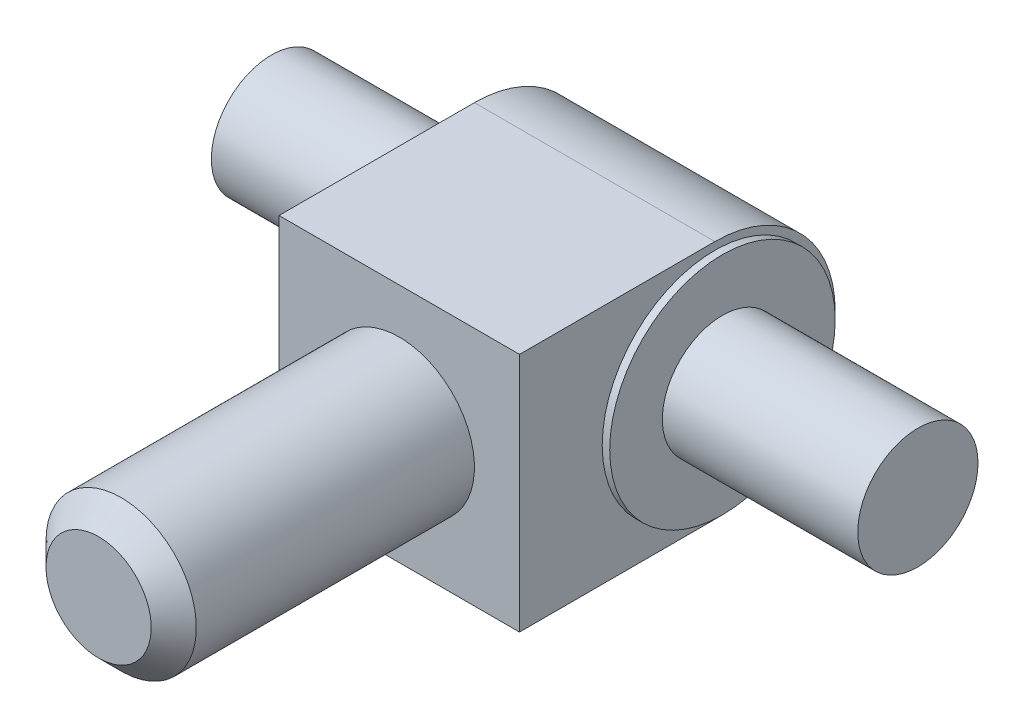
ISO-10303-21;
HEADER;
FILE_DESCRIPTION(('STEP AP214'),'2;1');
FILE_NAME('part.step','',(''),(''),'','','');
FILE_SCHEMA(('AUTOMOTIVE_DESIGN { 1 0 10303 214 1 1 1 1 }'));
ENDSEC;
DATA;
#1=APPLICATION_CONTEXT('core data for automotive mechanical design processes');
#2=APPLICATION_PROTOCOL_DEFINITION('international standard','automotive_design',2000,#1);
#3=PRODUCT_CONTEXT('',#1,'mechanical');
#4=PRODUCT('Part','Part','',(#3));
#5=PRODUCT_RELATED_PRODUCT_CATEGORY('part','',(#4));
#6=PRODUCT_DEFINITION_FORMATION('','',#4);
#7=PRODUCT_DEFINITION_CONTEXT('part definition',#1,'design');
#8=PRODUCT_DEFINITION('design','',#6,#7);
#9=PRODUCT_DEFINITION_SHAPE('','',#8);
#10=(LENGTH_UNIT() NAMED_UNIT(*) SI_UNIT(.MILLI.,.METRE.));
#11=(NAMED_UNIT(*) PLANE_ANGLE_UNIT() SI_UNIT($,.RADIAN.));
#12=(NAMED_UNIT(*) SI_UNIT($,.STERADIAN.) SOLID_ANGLE_UNIT());
#13=UNCERTAINTY_MEASURE_WITH_UNIT(LENGTH_MEASURE(1.E-05),#10,'distance_accuracy_value','');
#14=(GEOMETRIC_REPRESENTATION_CONTEXT(3) GLOBAL_UNCERTAINTY_ASSIGNED_CONTEXT((#13)) GLOBAL_UNIT_ASSIGNED_CONTEXT((#10,
#11,#12)) REPRESENTATION_CONTEXT('',''));
#15=CARTESIAN_POINT('',(0.,0.,0.));
#16=DIRECTION('',(0.,0.,1.));
#17=DIRECTION('',(1.,0.,0.));
#18=AXIS2_PLACEMENT_3D('',#15,#16,#17);
#19=CARTESIAN_POINT('',(-8.,-8.,-8.));
#20=DIRECTION('',(1.,0.,0.));
#21=DIRECTION('',(0.,1.,0.));
#22=AXIS2_PLACEMENT_3D('',#19,#20,#21);
#23=PLANE('',#22);
#24=CARTESIAN_POINT('',(-8.,0.,0.));
#25=DIRECTION('',(1.,0.,0.));
#26=DIRECTION('',(0.,1.,0.));
#27=AXIS2_PLACEMENT_3D('',#24,#25,#26);
#28=CIRCLE('',#27,8.);
#29=CARTESIAN_POINT('',(-8.,8.,0.));
#30=VERTEX_POINT('',#29);
#31=CARTESIAN_POINT('',(-8.,0.,-8.));
#32=VERTEX_POINT('',#31);
#33=EDGE_CURVE('E29',#30,#32,#28,.F.);
#34=ORIENTED_EDGE('',*,*,#33,.T.);
#35=CARTESIAN_POINT('',(-8.,0.,0.));
#36=DIRECTION('',(1.,0.,0.));
#37=DIRECTION('',(0.,1.,0.));
#38=AXIS2_PLACEMENT_3D('',#35,#36,#37);
#39=CIRCLE('',#38,8.);
#40=CARTESIAN_POINT('',(-8.,-8.,0.));
#41=VERTEX_POINT('',#40);
#42=EDGE_CURVE('E94',#32,#41,#39,.F.);
#43=ORIENTED_EDGE('',*,*,#42,.T.);
#44=DIRECTION('',(0.,0.,1.));
#45=VECTOR('',#44,1.);
#46=CARTESIAN_POINT('',(-8.,-8.,-8.));
#47=LINE('',#46,#45);
#48=CARTESIAN_POINT('',(-8.,-8.,13.));
#49=VERTEX_POINT('',#48);
#50=EDGE_CURVE('E66',#41,#49,#47,.T.);
#51=ORIENTED_EDGE('',*,*,#50,.T.);
#52=DIRECTION('',(0.,1.,0.));
#53=VECTOR('',#52,1.);
#54=CARTESIAN_POINT('',(-8.,-8.,13.));
#55=LINE('',#54,#53);
#56=CARTESIAN_POINT('',(-8.,8.,13.));
#57=VERTEX_POINT('',#56);
#58=EDGE_CURVE('E61',#49,#57,#55,.T.);
#59=ORIENTED_EDGE('',*,*,#58,.T.);
#60=DIRECTION('',(0.,0.,1.));
#61=VECTOR('',#60,1.);
#62=CARTESIAN_POINT('',(-8.,8.,-8.));
#63=LINE('',#62,#61);
#64=EDGE_CURVE('E64',#30,#57,#63,.T.);
#65=ORIENTED_EDGE('',*,*,#64,.F.);
#66=EDGE_LOOP('',(#34,#43,#51,#59,#65));
#67=FACE_BOUND('',#66,.T.);
#68=CARTESIAN_POINT('',(-8.,0.,0.));
#69=DIRECTION('',(1.,0.,0.));
#70=DIRECTION('',(0.,1.,0.));
#71=AXIS2_PLACEMENT_3D('',#68,#69,#70);
#72=CIRCLE('',#71,7.5);
#73=CARTESIAN_POINT('',(-8.,7.5,0.));
#74=VERTEX_POINT('',#73);
#75=EDGE_CURVE('E9',#74,#74,#72,.F.);
#76=ORIENTED_EDGE('',*,*,#75,.F.);
#77=EDGE_LOOP('',(#76));
#78=FACE_BOUND('',#77,.T.);
#79=ADVANCED_FACE('F14',(#67,#78),#23,.F.);
#80=CARTESIAN_POINT('',(8.,8.,-8.));
#81=DIRECTION('',(-1.,0.,0.));
#82=DIRECTION('',(0.,0.,-1.));
#83=AXIS2_PLACEMENT_3D('',#80,#81,#82);
#84=PLANE('',#83);
#85=DIRECTION('',(0.,0.,1.));
#86=VECTOR('',#85,1.);
#87=CARTESIAN_POINT('',(8.,-8.,-8.));
#88=LINE('',#87,#86);
#89=CARTESIAN_POINT('',(8.,-8.,0.));
#90=VERTEX_POINT('',#89);
#91=CARTESIAN_POINT('',(8.,-8.,13.));
#92=VERTEX_POINT('',#91);
#93=EDGE_CURVE('E83',#90,#92,#88,.T.);
#94=ORIENTED_EDGE('',*,*,#93,.F.);
#95=CARTESIAN_POINT('',(8.,0.,0.));
#96=DIRECTION('',(-1.,0.,0.));
#97=DIRECTION('',(0.,0.,-1.));
#98=AXIS2_PLACEMENT_3D('',#95,#96,#97);
#99=CIRCLE('',#98,8.);
#100=CARTESIAN_POINT('',(8.,0.,-8.));
#101=VERTEX_POINT('',#100);
#102=EDGE_CURVE('E91',#90,#101,#99,.F.);
#103=ORIENTED_EDGE('',*,*,#102,.T.);
#104=CARTESIAN_POINT('',(8.,0.,0.));
#105=DIRECTION('',(-1.,0.,0.));
#106=DIRECTION('',(0.,0.,-1.));
#107=AXIS2_PLACEMENT_3D('',#104,#105,#106);
#108=CIRCLE('',#107,8.);
#109=CARTESIAN_POINT('',(8.,8.,0.));
#110=VERTEX_POINT('',#109);
#111=EDGE_CURVE('E89',#101,#110,#108,.F.);
#112=ORIENTED_EDGE('',*,*,#111,.T.);
#113=DIRECTION('',(0.,0.,1.));
#114=VECTOR('',#113,1.);
#115=CARTESIAN_POINT('',(8.,8.,-8.));
#116=LINE('',#115,#114);
#117=CARTESIAN_POINT('',(8.,8.,13.));
#118=VERTEX_POINT('',#117);
#119=EDGE_CURVE('E81',#110,#118,#116,.T.);
#120=ORIENTED_EDGE('',*,*,#119,.T.);
#121=DIRECTION('',(0.,-1.,0.));
#122=VECTOR('',#121,1.);
#123=CARTESIAN_POINT('',(8.,8.,13.));
#124=LINE('',#123,#122);
#125=EDGE_CURVE('E77',#118,#92,#124,.T.);
#126=ORIENTED_EDGE('',*,*,#125,.T.);
#127=EDGE_LOOP('',(#94,#103,#112,#120,#126));
#128=FACE_BOUND('',#127,.T.);
#129=CARTESIAN_POINT('',(8.,0.,0.));
#130=DIRECTION('',(-1.,0.,0.));
#131=DIRECTION('',(0.,0.,1.));
#132=AXIS2_PLACEMENT_3D('',#129,#130,#131);
#133=CIRCLE('',#132,7.5);
#134=CARTESIAN_POINT('',(8.,0.,7.5));
#135=VERTEX_POINT('',#134);
#136=EDGE_CURVE('E22',#135,#135,#133,.F.);
#137=ORIENTED_EDGE('',*,*,#136,.F.);
#138=EDGE_LOOP('',(#137));
#139=FACE_BOUND('',#138,.T.);
#140=ADVANCED_FACE('F107',(#128,#139),#84,.F.);
#141=CARTESIAN_POINT('',(-8.,8.,13.));
#142=DIRECTION('',(0.,0.,1.));
#143=DIRECTION('',(-1.,0.,0.));
#144=AXIS2_PLACEMENT_3D('',#141,#142,#143);
#145=PLANE('',#144);
#146=DIRECTION('',(1.,0.,0.));
#147=VECTOR('',#146,1.);
#148=CARTESIAN_POINT('',(-8.,-8.,13.));
#149=LINE('',#148,#147);
#150=EDGE_CURVE('E71',#49,#92,#149,.T.);
#151=ORIENTED_EDGE('',*,*,#150,.T.);
#152=ORIENTED_EDGE('',*,*,#125,.F.);
#153=DIRECTION('',(-1.,0.,0.));
#154=VECTOR('',#153,1.);
#155=CARTESIAN_POINT('',(8.,8.,13.));
#156=LINE('',#155,#154);
#157=EDGE_CURVE('E74',#118,#57,#156,.T.);
#158=ORIENTED_EDGE('',*,*,#157,.T.);
#159=ORIENTED_EDGE('',*,*,#58,.F.);
#160=EDGE_LOOP('',(#151,#152,#158,#159));
#161=FACE_BOUND('',#160,.T.);
#162=CARTESIAN_POINT('',(0.,0.,13.));
#163=DIRECTION('',(0.,0.,1.));
#164=DIRECTION('',(-1.,0.,0.));
#165=AXIS2_PLACEMENT_3D('',#162,#163,#164);
#166=CIRCLE('',#165,5.);
#167=CARTESIAN_POINT('',(-5.,0.,13.));
#168=VERTEX_POINT('',#167);
#169=EDGE_CURVE('E142',#168,#168,#166,.T.);
#170=ORIENTED_EDGE('',*,*,#169,.F.);
#171=EDGE_LOOP('',(#170));
#172=FACE_BOUND('',#171,.T.);
#173=ADVANCED_FACE('F75',(#161,#172),#145,.T.);
#174=CARTESIAN_POINT('',(8.,8.,-8.));
#175=DIRECTION('',(0.,1.,0.));
#176=DIRECTION('',(-1.,0.,0.));
#177=AXIS2_PLACEMENT_3D('',#174,#175,#176);
#178=PLANE('',#177);
#179=ORIENTED_EDGE('',*,*,#119,.F.);
#180=DIRECTION('',(-1.,0.,0.));
#181=VECTOR('',#180,1.);
#182=CARTESIAN_POINT('',(8.,8.,0.));
#183=LINE('',#182,#181);
#184=EDGE_CURVE('E37',#110,#30,#183,.T.);
#185=ORIENTED_EDGE('',*,*,#184,.T.);
#186=ORIENTED_EDGE('',*,*,#64,.T.);
#187=ORIENTED_EDGE('',*,*,#157,.F.);
#188=EDGE_LOOP('',(#179,#185,#186,#187));
#189=FACE_BOUND('',#188,.T.);
#190=ADVANCED_FACE('F80',(#189),#178,.T.);
#191=CARTESIAN_POINT('',(-8.,-8.,-8.));
#192=DIRECTION('',(0.,-1.,0.));
#193=DIRECTION('',(1.,0.,0.));
#194=AXIS2_PLACEMENT_3D('',#191,#192,#193);
#195=PLANE('',#194);
#196=ORIENTED_EDGE('',*,*,#50,.F.);
#197=DIRECTION('',(1.,0.,0.));
#198=VECTOR('',#197,1.);
#199=CARTESIAN_POINT('',(-8.,-8.,0.));
#200=LINE('',#199,#198);
#201=EDGE_CURVE('E70',#41,#90,#200,.T.);
#202=ORIENTED_EDGE('',*,*,#201,.T.);
#203=ORIENTED_EDGE('',*,*,#93,.T.);
#204=ORIENTED_EDGE('',*,*,#150,.F.);
#205=EDGE_LOOP('',(#196,#202,#203,#204));
#206=FACE_BOUND('',#205,.T.);
#207=ADVANCED_FACE('F122',(#206),#195,.T.);
#208=CARTESIAN_POINT('',(8.,0.,0.));
#209=DIRECTION('',(1.,0.,0.));
#210=DIRECTION('',(0.,1.,0.));
#211=AXIS2_PLACEMENT_3D('',#208,#209,#210);
#212=CYLINDRICAL_SURFACE('',#211,8.);
#213=DIRECTION('',(-1.,0.,0.));
#214=VECTOR('',#213,1.);
#215=CARTESIAN_POINT('',(8.,0.,-8.));
#216=LINE('',#215,#214);
#217=EDGE_CURVE('E156',#32,#101,#216,.F.);
#218=ORIENTED_EDGE('',*,*,#217,.F.);
#219=ORIENTED_EDGE('',*,*,#33,.F.);
#220=ORIENTED_EDGE('',*,*,#184,.F.);
#221=ORIENTED_EDGE('',*,*,#111,.F.);
#222=EDGE_LOOP('',(#218,#219,#220,#221));
#223=FACE_BOUND('',#222,.T.);
#224=ADVANCED_FACE('F166',(#223),#212,.T.);
#225=CARTESIAN_POINT('',(-8.,0.,0.));
#226=DIRECTION('',(-1.,0.,0.));
#227=DIRECTION('',(0.,-1.,0.));
#228=AXIS2_PLACEMENT_3D('',#225,#226,#227);
#229=CYLINDRICAL_SURFACE('',#228,8.);
#230=ORIENTED_EDGE('',*,*,#42,.F.);
#231=ORIENTED_EDGE('',*,*,#217,.T.);
#232=ORIENTED_EDGE('',*,*,#102,.F.);
#233=ORIENTED_EDGE('',*,*,#201,.F.);
#234=EDGE_LOOP('',(#230,#231,#232,#233));
#235=FACE_BOUND('',#234,.T.);
#236=ADVANCED_FACE('F128',(#235),#229,.T.);
#237=CARTESIAN_POINT('',(0.,0.,33.));
#238=DIRECTION('',(0.,0.,1.));
#239=DIRECTION('',(-1.,0.,0.));
#240=AXIS2_PLACEMENT_3D('',#237,#238,#239);
#241=PLANE('',#240);
#242=CARTESIAN_POINT('',(0.,0.,33.));
#243=DIRECTION('',(0.,0.,1.));
#244=DIRECTION('',(-1.,0.,0.));
#245=AXIS2_PLACEMENT_3D('',#242,#243,#244);
#246=CIRCLE('',#245,3.5);
#247=CARTESIAN_POINT('',(-3.5,0.,33.));
#248=VERTEX_POINT('',#247);
#249=EDGE_CURVE('E97',#248,#248,#246,.T.);
#250=ORIENTED_EDGE('',*,*,#249,.T.);
#251=EDGE_LOOP('',(#250));
#252=FACE_BOUND('',#251,.T.);
#253=ADVANCED_FACE('F125',(#252),#241,.T.);
#254=CARTESIAN_POINT('',(0.,0.,33.));
#255=DIRECTION('',(0.,0.,-1.));
#256=DIRECTION('',(1.,0.,0.));
#257=AXIS2_PLACEMENT_3D('',#254,#255,#256);
#258=CYLINDRICAL_SURFACE('',#257,5.);
#259=CARTESIAN_POINT('',(0.,0.,31.5));
#260=DIRECTION('',(0.,0.,1.));
#261=DIRECTION('',(-1.,0.,0.));
#262=AXIS2_PLACEMENT_3D('',#259,#260,#261);
#263=CIRCLE('',#262,5.);
#264=CARTESIAN_POINT('',(-5.,0.,31.5));
#265=VERTEX_POINT('',#264);
#266=EDGE_CURVE('E100',#265,#265,#263,.F.);
#267=ORIENTED_EDGE('',*,*,#266,.T.);
#268=EDGE_LOOP('',(#267));
#269=FACE_BOUND('',#268,.T.);
#270=ORIENTED_EDGE('',*,*,#169,.T.);
#271=EDGE_LOOP('',(#270));
#272=FACE_BOUND('',#271,.T.);
#273=ADVANCED_FACE('F127',(#269,#272),#258,.T.);
#274=CARTESIAN_POINT('',(0.,0.,33.));
#275=DIRECTION('',(0.,0.,-1.));
#276=DIRECTION('',(1.,0.,0.));
#277=AXIS2_PLACEMENT_3D('',#274,#275,#276);
#278=CONICAL_SURFACE('',#277,3.5,0.785398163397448);
#279=ORIENTED_EDGE('',*,*,#266,.F.);
#280=EDGE_LOOP('',(#279));
#281=FACE_BOUND('',#280,.T.);
#282=ORIENTED_EDGE('',*,*,#249,.F.);
#283=EDGE_LOOP('',(#282));
#284=FACE_BOUND('',#283,.T.);
#285=ADVANCED_FACE('F16',(#281,#284),#278,.T.);
#286=CARTESIAN_POINT('',(8.5,0.,0.));
#287=DIRECTION('',(1.,0.,0.));
#288=DIRECTION('',(0.,0.,-1.));
#289=AXIS2_PLACEMENT_3D('',#286,#287,#288);
#290=PLANE('',#289);
#291=CARTESIAN_POINT('',(8.5,0.,0.));
#292=DIRECTION('',(1.,0.,0.));
#293=DIRECTION('',(0.,0.,-1.));
#294=AXIS2_PLACEMENT_3D('',#291,#292,#293);
#295=CIRCLE('',#294,7.5);
#296=CARTESIAN_POINT('',(8.5,0.,-7.5));
#297=VERTEX_POINT('',#296);
#298=EDGE_CURVE('E144',#297,#297,#295,.T.);
#299=ORIENTED_EDGE('',*,*,#298,.T.);
#300=EDGE_LOOP('',(#299));
#301=FACE_BOUND('',#300,.T.);
#302=CARTESIAN_POINT('',(8.5,0.,0.));
#303=DIRECTION('',(1.,0.,0.));
#304=DIRECTION('',(0.,0.,-1.));
#305=AXIS2_PLACEMENT_3D('',#302,#303,#304);
#306=CIRCLE('',#305,4.);
#307=CARTESIAN_POINT('',(8.5,0.,-4.));
#308=VERTEX_POINT('',#307);
#309=EDGE_CURVE('E150',#308,#308,#306,.T.);
#310=ORIENTED_EDGE('',*,*,#309,.F.);
#311=EDGE_LOOP('',(#310));
#312=FACE_BOUND('',#311,.T.);
#313=ADVANCED_FACE('F136',(#301,#312),#290,.T.);
#314=CARTESIAN_POINT('',(8.5,0.,0.));
#315=DIRECTION('',(-1.,0.,0.));
#316=DIRECTION('',(0.,0.,1.));
#317=AXIS2_PLACEMENT_3D('',#314,#315,#316);
#318=CYLINDRICAL_SURFACE('',#317,7.5);
#319=ORIENTED_EDGE('',*,*,#298,.F.);
#320=EDGE_LOOP('',(#319));
#321=FACE_BOUND('',#320,.T.);
#322=ORIENTED_EDGE('',*,*,#136,.T.);
#323=EDGE_LOOP('',(#322));
#324=FACE_BOUND('',#323,.T.);
#325=ADVANCED_FACE('F105',(#321,#324),#318,.T.);
#326=CARTESIAN_POINT('',(21.5,0.,0.));
#327=DIRECTION('',(-1.,0.,0.));
#328=DIRECTION('',(0.,-1.,0.));
#329=AXIS2_PLACEMENT_3D('',#326,#327,#328);
#330=PLANE('',#329);
#331=CARTESIAN_POINT('',(21.5,0.,0.));
#332=DIRECTION('',(-1.,0.,0.));
#333=DIRECTION('',(0.,-1.,0.));
#334=AXIS2_PLACEMENT_3D('',#331,#332,#333);
#335=CIRCLE('',#334,4.);
#336=CARTESIAN_POINT('',(21.5,-4.,0.));
#337=VERTEX_POINT('',#336);
#338=EDGE_CURVE('E143',#337,#337,#335,.T.);
#339=ORIENTED_EDGE('',*,*,#338,.F.);
#340=EDGE_LOOP('',(#339));
#341=FACE_BOUND('',#340,.T.);
#342=ADVANCED_FACE('F187',(#341),#330,.F.);
#343=CARTESIAN_POINT('',(-21.5,0.,0.));
#344=DIRECTION('',(1.,0.,0.));
#345=DIRECTION('',(0.,1.,0.));
#346=AXIS2_PLACEMENT_3D('',#343,#344,#345);
#347=CYLINDRICAL_SURFACE('',#346,4.);
#348=ORIENTED_EDGE('',*,*,#309,.T.);
#349=EDGE_LOOP('',(#348));
#350=FACE_BOUND('',#349,.T.);
#351=ORIENTED_EDGE('',*,*,#338,.T.);
#352=EDGE_LOOP('',(#351));
#353=FACE_BOUND('',#352,.T.);
#354=ADVANCED_FACE('F182',(#350,#353),#347,.T.);
#355=CARTESIAN_POINT('',(-8.5,0.,0.));
#356=DIRECTION('',(-1.,0.,0.));
#357=DIRECTION('',(0.,-1.,0.));
#358=AXIS2_PLACEMENT_3D('',#355,#356,#357);
#359=PLANE('',#358);
#360=CARTESIAN_POINT('',(-8.5,0.,0.));
#361=DIRECTION('',(-1.,0.,0.));
#362=DIRECTION('',(0.,-1.,0.));
#363=AXIS2_PLACEMENT_3D('',#360,#361,#362);
#364=CIRCLE('',#363,7.5);
#365=CARTESIAN_POINT('',(-8.5,-7.5,0.));
#366=VERTEX_POINT('',#365);
#367=EDGE_CURVE('E211',#366,#366,#364,.T.);
#368=ORIENTED_EDGE('',*,*,#367,.T.);
#369=EDGE_LOOP('',(#368));
#370=FACE_BOUND('',#369,.T.);
#371=CARTESIAN_POINT('',(-8.5,0.,0.));
#372=DIRECTION('',(-1.,0.,0.));
#373=DIRECTION('',(0.,-1.,0.));
#374=AXIS2_PLACEMENT_3D('',#371,#372,#373);
#375=CIRCLE('',#374,4.);
#376=CARTESIAN_POINT('',(-8.5,-4.,0.));
#377=VERTEX_POINT('',#376);
#378=EDGE_CURVE('E214',#377,#377,#375,.T.);
#379=ORIENTED_EDGE('',*,*,#378,.F.);
#380=EDGE_LOOP('',(#379));
#381=FACE_BOUND('',#380,.T.);
#382=ADVANCED_FACE('F199',(#370,#381),#359,.T.);
#383=CARTESIAN_POINT('',(-8.5,0.,0.));
#384=DIRECTION('',(1.,0.,0.));
#385=DIRECTION('',(0.,1.,0.));
#386=AXIS2_PLACEMENT_3D('',#383,#384,#385);
#387=CYLINDRICAL_SURFACE('',#386,7.5);
#388=ORIENTED_EDGE('',*,*,#367,.F.);
#389=EDGE_LOOP('',(#388));
#390=FACE_BOUND('',#389,.T.);
#391=ORIENTED_EDGE('',*,*,#75,.T.);
#392=EDGE_LOOP('',(#391));
#393=FACE_BOUND('',#392,.T.);
#394=ADVANCED_FACE('F185',(#390,#393),#387,.T.);
#395=CARTESIAN_POINT('',(-21.5,0.,0.));
#396=DIRECTION('',(-1.,0.,0.));
#397=DIRECTION('',(0.,-1.,0.));
#398=AXIS2_PLACEMENT_3D('',#395,#396,#397);
#399=PLANE('',#398);
#400=CARTESIAN_POINT('',(-21.5,0.,0.));
#401=DIRECTION('',(-1.,0.,0.));
#402=DIRECTION('',(0.,-1.,0.));
#403=AXIS2_PLACEMENT_3D('',#400,#401,#402);
#404=CIRCLE('',#403,4.);
#405=CARTESIAN_POINT('',(-21.5,-4.,0.));
#406=VERTEX_POINT('',#405);
#407=EDGE_CURVE('E147',#406,#406,#404,.T.);
#408=ORIENTED_EDGE('',*,*,#407,.T.);
#409=EDGE_LOOP('',(#408));
#410=FACE_BOUND('',#409,.T.);
#411=ADVANCED_FACE('F180',(#410),#399,.T.);
#412=ORIENTED_EDGE('',*,*,#378,.T.);
#413=EDGE_LOOP('',(#412));
#414=FACE_BOUND('',#413,.T.);
#415=ORIENTED_EDGE('',*,*,#407,.F.);
#416=EDGE_LOOP('',(#415));
#417=FACE_BOUND('',#416,.T.);
#418=ADVANCED_FACE('F177',(#414,#417),#347,.T.);
#419=CLOSED_SHELL('',(#79,#140,#173,#190,#207,#224,#236,#253,#273,#285,#313,#325,#342,#354,#382,
#394,#411,#418));
#420=MANIFOLD_SOLID_BREP('B1',#419);
#421=ADVANCED_BREP_SHAPE_REPRESENTATION('',(#18,#420),#14);
#422=SHAPE_DEFINITION_REPRESENTATION(#9,#421);
ENDSEC;
END-ISO-10303-21;
